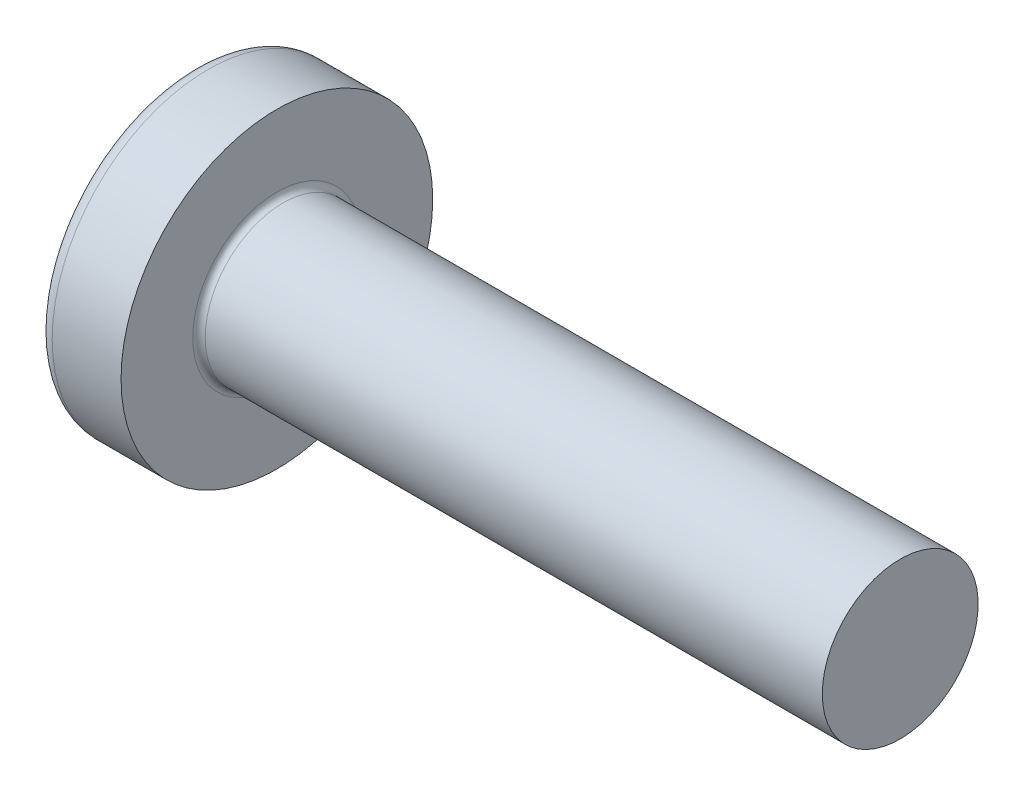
from build123d import *

# Parameters (mm, degrees)
FILLET1_R    = 0.1
RECPAT_COUNT = 2
RECPAT_ANGLE = 90


with BuildPart() as part:
    # BodySke → Base-Revolve (revolve)
    with BuildSketch(Plane.XY, mode=Mode.PRIVATE) as base_revolve_sk:
        with BuildLine():
            Line((2.1, 1.25), (2.1, 2.5))
            Line((2.1, 2.5), (0.99500416, 2.5))
            ThreePointArc((0.99500416, 2.5), (0.88781572, 2.474733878), (0.803195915, 2.404255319))
            ThreePointArc((0.803195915, 2.404255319), (0.206109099, 1.267435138), (0, 0))
            Line((0, 0), (12.1, 0))
            Line((12.1, 0), (12.1, 1.25))
            Line((12.1, 1.25), (2.1, 1.25))
        make_face()
    revolve(base_revolve_sk.sketch.rotate(Axis((0.99500416, 0, 0), (1, 0, 0)), 90), axis=Axis((0.99500416, 0, 0), (1, 0, 0)))

    # Fillet1
    fillet1_edges = [part.edges().sort_by_distance(p)[0] for p in [
        (2.1, 0, -1.25),
    ]]
    fillet(fillet1_edges, radius=FILLET1_R)

    # Sketch3 → Recess section 0
    with BuildSketch(Plane(origin=(0, 0, 0), x_dir=(0, 0, -1), z_dir=(1, 0, 0))):
        with BuildLine():
            Line((0.37, -1.3), (-0.37, -1.3))
            Line((-0.37, -1.3), (-0.37, 1.3))
            Line((-0.37, 1.3), (0.37, 1.3))
            Line((0.37, 1.3), (0.37, -1.3))
        make_face()
    # Sketch4 → Recess section 1
    with BuildSketch(Plane(origin=(1.5, 0, 0), x_dir=(0, 0, -1), z_dir=(1, 0, 0))):
        with BuildLine():
            Line((0.37, -0.552127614), (-0.37, -0.552127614))
            Line((-0.37, -0.552127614), (-0.37, 0.552127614))
            Line((-0.37, 0.552127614), (0.37, 0.552127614))
            Line((0.37, 0.552127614), (0.37, -0.552127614))
        make_face()
    recess = loft(mode=Mode.SUBTRACT)

    # RecPat: Recess ×2 about axis
    recpat_axis = Axis((0, 0, 0), (1, 0, 0))
    for i in range(1, RECPAT_COUNT):
        add(recess.rotate(recpat_axis, i * RECPAT_ANGLE / (RECPAT_COUNT - 1)), mode=Mode.SUBTRACT)

    # RecCorSke → RecessCore (revolve, cut)
    with BuildSketch(Plane.XY, mode=Mode.PRIVATE) as recesscore_sk:
        Polygon((0, 0), (0, 0.660890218), (1.5, 0.556), (1.680655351, 0), align=None)
    revolve(recesscore_sk.sketch.rotate(Axis((-3.175, 0, 0), (1, 0, 0)), 17.145865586), axis=Axis((-3.175, 0, 0), (1, 0, 0)), mode=Mode.SUBTRACT)


solid = part.part
